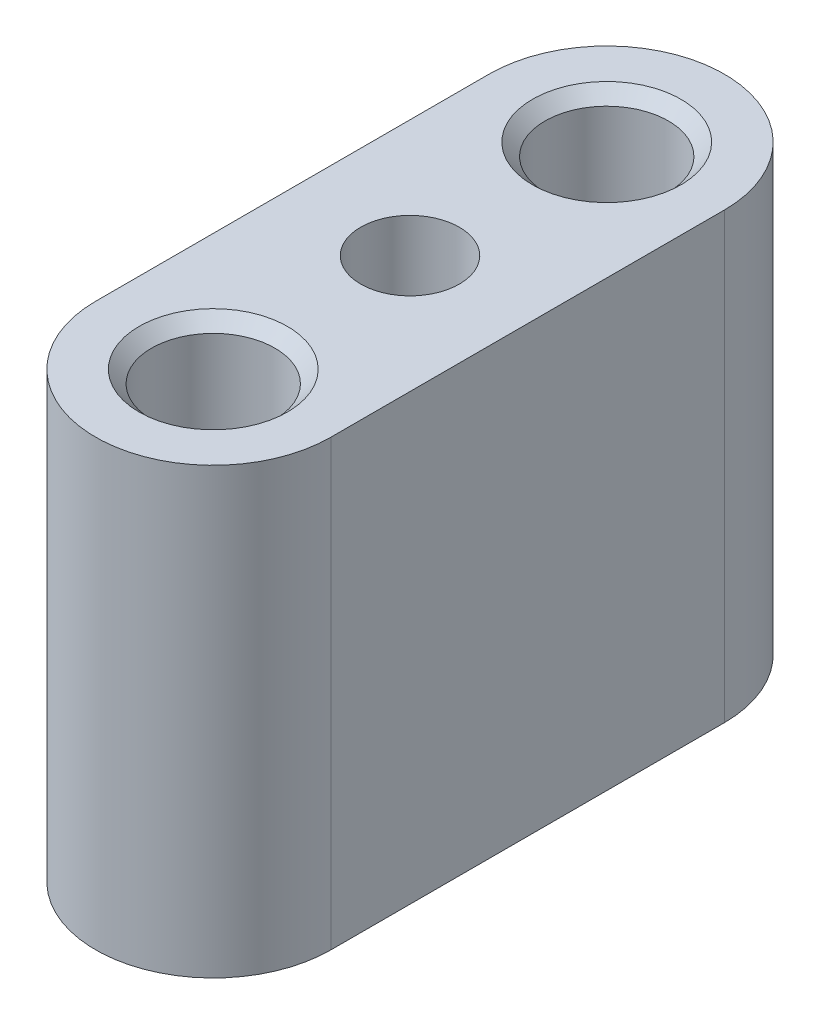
ISO-10303-21;
HEADER;
FILE_DESCRIPTION(('STEP AP214'),'2;1');
FILE_NAME('part.step','',(''),(''),'','','');
FILE_SCHEMA(('AUTOMOTIVE_DESIGN { 1 0 10303 214 1 1 1 1 }'));
ENDSEC;
DATA;
#1=APPLICATION_CONTEXT('core data for automotive mechanical design processes');
#2=APPLICATION_PROTOCOL_DEFINITION('international standard','automotive_design',2000,#1);
#3=PRODUCT_CONTEXT('',#1,'mechanical');
#4=PRODUCT('Part','Part','',(#3));
#5=PRODUCT_RELATED_PRODUCT_CATEGORY('part','',(#4));
#6=PRODUCT_DEFINITION_FORMATION('','',#4);
#7=PRODUCT_DEFINITION_CONTEXT('part definition',#1,'design');
#8=PRODUCT_DEFINITION('design','',#6,#7);
#9=PRODUCT_DEFINITION_SHAPE('','',#8);
#10=(LENGTH_UNIT() NAMED_UNIT(*) SI_UNIT(.MILLI.,.METRE.));
#11=(NAMED_UNIT(*) PLANE_ANGLE_UNIT() SI_UNIT($,.RADIAN.));
#12=(NAMED_UNIT(*) SI_UNIT($,.STERADIAN.) SOLID_ANGLE_UNIT());
#13=UNCERTAINTY_MEASURE_WITH_UNIT(LENGTH_MEASURE(1.E-05),#10,'distance_accuracy_value','');
#14=(GEOMETRIC_REPRESENTATION_CONTEXT(3) GLOBAL_UNCERTAINTY_ASSIGNED_CONTEXT((#13)) GLOBAL_UNIT_ASSIGNED_CONTEXT((#10,
#11,#12)) REPRESENTATION_CONTEXT('',''));
#15=CARTESIAN_POINT('',(0.,0.,0.));
#16=DIRECTION('',(0.,0.,1.));
#17=DIRECTION('',(1.,0.,0.));
#18=AXIS2_PLACEMENT_3D('',#15,#16,#17);
#19=CARTESIAN_POINT('',(0.,9.,-3.9878));
#20=DIRECTION('',(0.,-1.,0.));
#21=DIRECTION('',(0.,0.,-1.));
#22=AXIS2_PLACEMENT_3D('',#19,#20,#21);
#23=CYLINDRICAL_SURFACE('',#22,2.385);
#24=CARTESIAN_POINT('',(0.,0.,-3.9878));
#25=DIRECTION('',(0.,1.,0.));
#26=DIRECTION('',(0.,0.,1.));
#27=AXIS2_PLACEMENT_3D('',#24,#25,#26);
#28=CIRCLE('',#27,2.385);
#29=CARTESIAN_POINT('',(2.385,0.,-3.9878));
#30=VERTEX_POINT('',#29);
#31=CARTESIAN_POINT('',(-2.385,0.,-3.9878));
#32=VERTEX_POINT('',#31);
#33=EDGE_CURVE('E105',#30,#32,#28,.T.);
#34=ORIENTED_EDGE('',*,*,#33,.T.);
#35=DIRECTION('',(0.,-1.,0.));
#36=VECTOR('',#35,1.);
#37=CARTESIAN_POINT('',(-2.385,9.,-3.9878));
#38=LINE('',#37,#36);
#39=CARTESIAN_POINT('',(-2.385,9.,-3.9878));
#40=VERTEX_POINT('',#39);
#41=EDGE_CURVE('E130',#40,#32,#38,.T.);
#42=ORIENTED_EDGE('',*,*,#41,.F.);
#43=CARTESIAN_POINT('',(0.,9.,-3.9878));
#44=DIRECTION('',(0.,1.,0.));
#45=DIRECTION('',(0.,0.,1.));
#46=AXIS2_PLACEMENT_3D('',#43,#44,#45);
#47=CIRCLE('',#46,2.385);
#48=CARTESIAN_POINT('',(2.385,9.,-3.9878));
#49=VERTEX_POINT('',#48);
#50=EDGE_CURVE('E112',#49,#40,#47,.T.);
#51=ORIENTED_EDGE('',*,*,#50,.F.);
#52=DIRECTION('',(0.,-1.,0.));
#53=VECTOR('',#52,1.);
#54=CARTESIAN_POINT('',(2.385,9.,-3.9878));
#55=LINE('',#54,#53);
#56=EDGE_CURVE('E118',#49,#30,#55,.T.);
#57=ORIENTED_EDGE('',*,*,#56,.T.);
#58=EDGE_LOOP('',(#34,#42,#51,#57));
#59=FACE_BOUND('',#58,.T.);
#60=ADVANCED_FACE('F35',(#59),#23,.T.);
#61=CARTESIAN_POINT('',(-2.385,9.,-3.9878));
#62=DIRECTION('',(1.,0.,0.));
#63=DIRECTION('',(0.,0.,-1.));
#64=AXIS2_PLACEMENT_3D('',#61,#62,#63);
#65=PLANE('',#64);
#66=DIRECTION('',(0.,0.,1.));
#67=VECTOR('',#66,1.);
#68=CARTESIAN_POINT('',(-2.385,0.,-3.9878));
#69=LINE('',#68,#67);
#70=CARTESIAN_POINT('',(-2.385,0.,3.9878));
#71=VERTEX_POINT('',#70);
#72=EDGE_CURVE('E121',#32,#71,#69,.T.);
#73=ORIENTED_EDGE('',*,*,#72,.T.);
#74=DIRECTION('',(0.,-1.,0.));
#75=VECTOR('',#74,1.);
#76=CARTESIAN_POINT('',(-2.385,9.,3.9878));
#77=LINE('',#76,#75);
#78=CARTESIAN_POINT('',(-2.385,9.,3.9878));
#79=VERTEX_POINT('',#78);
#80=EDGE_CURVE('E128',#79,#71,#77,.T.);
#81=ORIENTED_EDGE('',*,*,#80,.F.);
#82=DIRECTION('',(0.,0.,1.));
#83=VECTOR('',#82,1.);
#84=CARTESIAN_POINT('',(-2.385,9.,-3.9878));
#85=LINE('',#84,#83);
#86=EDGE_CURVE('E84',#40,#79,#85,.T.);
#87=ORIENTED_EDGE('',*,*,#86,.F.);
#88=ORIENTED_EDGE('',*,*,#41,.T.);
#89=EDGE_LOOP('',(#73,#81,#87,#88));
#90=FACE_BOUND('',#89,.T.);
#91=ADVANCED_FACE('F167',(#90),#65,.F.);
#92=CARTESIAN_POINT('',(0.,9.,3.9878));
#93=DIRECTION('',(0.,-1.,0.));
#94=DIRECTION('',(0.,0.,-1.));
#95=AXIS2_PLACEMENT_3D('',#92,#93,#94);
#96=CYLINDRICAL_SURFACE('',#95,2.385);
#97=CARTESIAN_POINT('',(0.,0.,3.9878));
#98=DIRECTION('',(0.,1.,0.));
#99=DIRECTION('',(0.,0.,1.));
#100=AXIS2_PLACEMENT_3D('',#97,#98,#99);
#101=CIRCLE('',#100,2.385);
#102=CARTESIAN_POINT('',(2.385,0.,3.9878));
#103=VERTEX_POINT('',#102);
#104=EDGE_CURVE('E70',#71,#103,#101,.T.);
#105=ORIENTED_EDGE('',*,*,#104,.T.);
#106=DIRECTION('',(0.,-1.,0.));
#107=VECTOR('',#106,1.);
#108=CARTESIAN_POINT('',(2.385,9.,3.9878));
#109=LINE('',#108,#107);
#110=CARTESIAN_POINT('',(2.385,9.,3.9878));
#111=VERTEX_POINT('',#110);
#112=EDGE_CURVE('E126',#111,#103,#109,.T.);
#113=ORIENTED_EDGE('',*,*,#112,.F.);
#114=CARTESIAN_POINT('',(0.,9.,3.9878));
#115=DIRECTION('',(0.,1.,0.));
#116=DIRECTION('',(0.,0.,1.));
#117=AXIS2_PLACEMENT_3D('',#114,#115,#116);
#118=CIRCLE('',#117,2.385);
#119=EDGE_CURVE('E115',#79,#111,#118,.T.);
#120=ORIENTED_EDGE('',*,*,#119,.F.);
#121=ORIENTED_EDGE('',*,*,#80,.T.);
#122=EDGE_LOOP('',(#105,#113,#120,#121));
#123=FACE_BOUND('',#122,.T.);
#124=ADVANCED_FACE('F173',(#123),#96,.T.);
#125=CARTESIAN_POINT('',(2.385,9.,3.9878));
#126=DIRECTION('',(-1.,0.,0.));
#127=DIRECTION('',(0.,0.,1.));
#128=AXIS2_PLACEMENT_3D('',#125,#126,#127);
#129=PLANE('',#128);
#130=DIRECTION('',(0.,0.,-1.));
#131=VECTOR('',#130,1.);
#132=CARTESIAN_POINT('',(2.385,0.,3.9878));
#133=LINE('',#132,#131);
#134=EDGE_CURVE('E76',#103,#30,#133,.T.);
#135=ORIENTED_EDGE('',*,*,#134,.T.);
#136=ORIENTED_EDGE('',*,*,#56,.F.);
#137=DIRECTION('',(0.,0.,-1.));
#138=VECTOR('',#137,1.);
#139=CARTESIAN_POINT('',(2.385,9.,3.9878));
#140=LINE('',#139,#138);
#141=EDGE_CURVE('E52',#111,#49,#140,.T.);
#142=ORIENTED_EDGE('',*,*,#141,.F.);
#143=ORIENTED_EDGE('',*,*,#112,.T.);
#144=EDGE_LOOP('',(#135,#136,#142,#143));
#145=FACE_BOUND('',#144,.T.);
#146=ADVANCED_FACE('F178',(#145),#129,.F.);
#147=CARTESIAN_POINT('',(0.,9.,-3.9878));
#148=DIRECTION('',(0.,1.,0.));
#149=DIRECTION('',(0.,0.,1.));
#150=AXIS2_PLACEMENT_3D('',#147,#148,#149);
#151=PLANE('',#150);
#152=CARTESIAN_POINT('',(0.,9.,-3.9878));
#153=DIRECTION('',(0.,1.,0.));
#154=DIRECTION('',(0.,0.,1.));
#155=AXIS2_PLACEMENT_3D('',#152,#153,#154);
#156=CIRCLE('',#155,1.50399999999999);
#157=CARTESIAN_POINT('',(0.,9.,-2.48380000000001));
#158=VERTEX_POINT('',#157);
#159=EDGE_CURVE('E44',#158,#158,#156,.F.);
#160=ORIENTED_EDGE('',*,*,#159,.T.);
#161=EDGE_LOOP('',(#160));
#162=FACE_BOUND('',#161,.T.);
#163=CARTESIAN_POINT('',(0.,9.,3.9878));
#164=DIRECTION('',(0.,1.,0.));
#165=DIRECTION('',(0.,0.,1.));
#166=AXIS2_PLACEMENT_3D('',#163,#164,#165);
#167=CIRCLE('',#166,1.50399999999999);
#168=CARTESIAN_POINT('',(0.,9.,5.49179999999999));
#169=VERTEX_POINT('',#168);
#170=EDGE_CURVE('E135',#169,#169,#167,.F.);
#171=ORIENTED_EDGE('',*,*,#170,.T.);
#172=EDGE_LOOP('',(#171));
#173=FACE_BOUND('',#172,.T.);
#174=CARTESIAN_POINT('',(0.,9.,0.));
#175=DIRECTION('',(0.,1.,0.));
#176=DIRECTION('',(0.,0.,1.));
#177=AXIS2_PLACEMENT_3D('',#174,#175,#176);
#178=CIRCLE('',#177,1.);
#179=CARTESIAN_POINT('',(0.,9.,1.));
#180=VERTEX_POINT('',#179);
#181=EDGE_CURVE('E108',#180,#180,#178,.T.);
#182=ORIENTED_EDGE('',*,*,#181,.F.);
#183=EDGE_LOOP('',(#182));
#184=FACE_BOUND('',#183,.T.);
#185=ORIENTED_EDGE('',*,*,#50,.T.);
#186=ORIENTED_EDGE('',*,*,#86,.T.);
#187=ORIENTED_EDGE('',*,*,#119,.T.);
#188=ORIENTED_EDGE('',*,*,#141,.T.);
#189=EDGE_LOOP('',(#185,#186,#187,#188));
#190=FACE_BOUND('',#189,.T.);
#191=ADVANCED_FACE('F140',(#162,#173,#184,#190),#151,.T.);
#192=CARTESIAN_POINT('',(0.,0.,-3.9878));
#193=DIRECTION('',(0.,1.,0.));
#194=DIRECTION('',(0.,0.,1.));
#195=AXIS2_PLACEMENT_3D('',#192,#193,#194);
#196=PLANE('',#195);
#197=CARTESIAN_POINT('',(0.,0.,0.));
#198=DIRECTION('',(0.,1.,0.));
#199=DIRECTION('',(0.,0.,1.));
#200=AXIS2_PLACEMENT_3D('',#197,#198,#199);
#201=CIRCLE('',#200,0.999999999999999);
#202=CARTESIAN_POINT('',(0.,0.,0.999999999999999));
#203=VERTEX_POINT('',#202);
#204=EDGE_CURVE('E102',#203,#203,#201,.T.);
#205=ORIENTED_EDGE('',*,*,#204,.T.);
#206=EDGE_LOOP('',(#205));
#207=FACE_BOUND('',#206,.T.);
#208=ORIENTED_EDGE('',*,*,#33,.F.);
#209=ORIENTED_EDGE('',*,*,#134,.F.);
#210=ORIENTED_EDGE('',*,*,#104,.F.);
#211=ORIENTED_EDGE('',*,*,#72,.F.);
#212=EDGE_LOOP('',(#208,#209,#210,#211));
#213=FACE_BOUND('',#212,.T.);
#214=ADVANCED_FACE('F156',(#207,#213),#196,.F.);
#215=CARTESIAN_POINT('',(0.,2.49760000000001,-3.9878));
#216=DIRECTION('',(0.,1.,0.));
#217=DIRECTION('',(0.,0.,1.));
#218=AXIS2_PLACEMENT_3D('',#215,#216,#217);
#219=CONICAL_SURFACE('',#218,1.24999999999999,1.02974425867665);
#220=CARTESIAN_POINT('',(0.,1.74652422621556,-3.9878));
#221=VERTEX_POINT('',#220);
#222=VERTEX_LOOP('',#221);
#223=FACE_BOUND('',#222,.T.);
#224=CARTESIAN_POINT('',(0.,2.49760000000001,-3.9878));
#225=DIRECTION('',(0.,1.,0.));
#226=DIRECTION('',(0.,0.,1.));
#227=AXIS2_PLACEMENT_3D('',#224,#225,#226);
#228=CIRCLE('',#227,1.24999999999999);
#229=CARTESIAN_POINT('',(0.,2.49760000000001,-2.73780000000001));
#230=VERTEX_POINT('',#229);
#231=EDGE_CURVE('E101',#230,#230,#228,.T.);
#232=ORIENTED_EDGE('',*,*,#231,.T.);
#233=EDGE_LOOP('',(#232));
#234=FACE_BOUND('',#233,.T.);
#235=ADVANCED_FACE('F151',(#223,#234),#219,.F.);
#236=CARTESIAN_POINT('',(0.,9.,-3.9878));
#237=DIRECTION('',(0.,1.,0.));
#238=DIRECTION('',(0.,0.,1.));
#239=AXIS2_PLACEMENT_3D('',#236,#237,#238);
#240=CYLINDRICAL_SURFACE('',#239,1.24999999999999);
#241=CARTESIAN_POINT('',(0.,8.746,-3.9878));
#242=DIRECTION('',(0.,1.,0.));
#243=DIRECTION('',(0.,0.,1.));
#244=AXIS2_PLACEMENT_3D('',#241,#242,#243);
#245=CIRCLE('',#244,1.24999999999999);
#246=CARTESIAN_POINT('',(0.,8.746,-2.73780000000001));
#247=VERTEX_POINT('',#246);
#248=EDGE_CURVE('E132',#247,#247,#245,.T.);
#249=ORIENTED_EDGE('',*,*,#248,.T.);
#250=EDGE_LOOP('',(#249));
#251=FACE_BOUND('',#250,.T.);
#252=ORIENTED_EDGE('',*,*,#231,.F.);
#253=EDGE_LOOP('',(#252));
#254=FACE_BOUND('',#253,.T.);
#255=ADVANCED_FACE('F95',(#251,#254),#240,.F.);
#256=CARTESIAN_POINT('',(0.,2.49760000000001,3.9878));
#257=DIRECTION('',(0.,1.,0.));
#258=DIRECTION('',(0.,0.,1.));
#259=AXIS2_PLACEMENT_3D('',#256,#257,#258);
#260=CONICAL_SURFACE('',#259,1.24999999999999,1.02974425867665);
#261=CARTESIAN_POINT('',(0.,1.74652422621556,3.9878));
#262=VERTEX_POINT('',#261);
#263=VERTEX_LOOP('',#262);
#264=FACE_BOUND('',#263,.T.);
#265=CARTESIAN_POINT('',(0.,2.49760000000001,3.9878));
#266=DIRECTION('',(0.,1.,0.));
#267=DIRECTION('',(0.,0.,1.));
#268=AXIS2_PLACEMENT_3D('',#265,#266,#267);
#269=CIRCLE('',#268,1.24999999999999);
#270=CARTESIAN_POINT('',(0.,2.49760000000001,5.23779999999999));
#271=VERTEX_POINT('',#270);
#272=EDGE_CURVE('E99',#271,#271,#269,.T.);
#273=ORIENTED_EDGE('',*,*,#272,.T.);
#274=EDGE_LOOP('',(#273));
#275=FACE_BOUND('',#274,.T.);
#276=ADVANCED_FACE('F91',(#264,#275),#260,.F.);
#277=CARTESIAN_POINT('',(0.,9.,3.9878));
#278=DIRECTION('',(0.,1.,0.));
#279=DIRECTION('',(0.,0.,1.));
#280=AXIS2_PLACEMENT_3D('',#277,#278,#279);
#281=CYLINDRICAL_SURFACE('',#280,1.24999999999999);
#282=CARTESIAN_POINT('',(0.,8.746,3.9878));
#283=DIRECTION('',(0.,1.,0.));
#284=DIRECTION('',(0.,0.,1.));
#285=AXIS2_PLACEMENT_3D('',#282,#283,#284);
#286=CIRCLE('',#285,1.24999999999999);
#287=CARTESIAN_POINT('',(0.,8.746,5.23779999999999));
#288=VERTEX_POINT('',#287);
#289=EDGE_CURVE('E11',#288,#288,#286,.T.);
#290=ORIENTED_EDGE('',*,*,#289,.T.);
#291=EDGE_LOOP('',(#290));
#292=FACE_BOUND('',#291,.T.);
#293=ORIENTED_EDGE('',*,*,#272,.F.);
#294=EDGE_LOOP('',(#293));
#295=FACE_BOUND('',#294,.T.);
#296=ADVANCED_FACE('F94',(#292,#295),#281,.F.);
#297=CARTESIAN_POINT('',(0.,9.,0.));
#298=DIRECTION('',(0.,1.,0.));
#299=DIRECTION('',(0.,0.,1.));
#300=AXIS2_PLACEMENT_3D('',#297,#298,#299);
#301=CYLINDRICAL_SURFACE('',#300,1.);
#302=ORIENTED_EDGE('',*,*,#204,.F.);
#303=EDGE_LOOP('',(#302));
#304=FACE_BOUND('',#303,.T.);
#305=ORIENTED_EDGE('',*,*,#181,.T.);
#306=EDGE_LOOP('',(#305));
#307=FACE_BOUND('',#306,.T.);
#308=ADVANCED_FACE('F146',(#304,#307),#301,.F.);
#309=CARTESIAN_POINT('',(0.,8.746,-3.9878));
#310=DIRECTION('',(0.,1.,0.));
#311=DIRECTION('',(0.,0.,1.));
#312=AXIS2_PLACEMENT_3D('',#309,#310,#311);
#313=CONICAL_SURFACE('',#312,1.24999999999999,0.78539816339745);
#314=ORIENTED_EDGE('',*,*,#159,.F.);
#315=EDGE_LOOP('',(#314));
#316=FACE_BOUND('',#315,.T.);
#317=ORIENTED_EDGE('',*,*,#248,.F.);
#318=EDGE_LOOP('',(#317));
#319=FACE_BOUND('',#318,.T.);
#320=ADVANCED_FACE('F143',(#316,#319),#313,.F.);
#321=CARTESIAN_POINT('',(0.,8.746,3.9878));
#322=DIRECTION('',(0.,1.,0.));
#323=DIRECTION('',(0.,0.,1.));
#324=AXIS2_PLACEMENT_3D('',#321,#322,#323);
#325=CONICAL_SURFACE('',#324,1.24999999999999,0.78539816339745);
#326=ORIENTED_EDGE('',*,*,#170,.F.);
#327=EDGE_LOOP('',(#326));
#328=FACE_BOUND('',#327,.T.);
#329=ORIENTED_EDGE('',*,*,#289,.F.);
#330=EDGE_LOOP('',(#329));
#331=FACE_BOUND('',#330,.T.);
#332=ADVANCED_FACE('F37',(#328,#331),#325,.F.);
#333=CLOSED_SHELL('',(#60,#91,#124,#146,#191,#214,#235,#255,#276,#296,#308,#320,#332));
#334=MANIFOLD_SOLID_BREP('B2',#333);
#335=ADVANCED_BREP_SHAPE_REPRESENTATION('',(#18,#334),#14);
#336=SHAPE_DEFINITION_REPRESENTATION(#9,#335);
ENDSEC;
END-ISO-10303-21;
